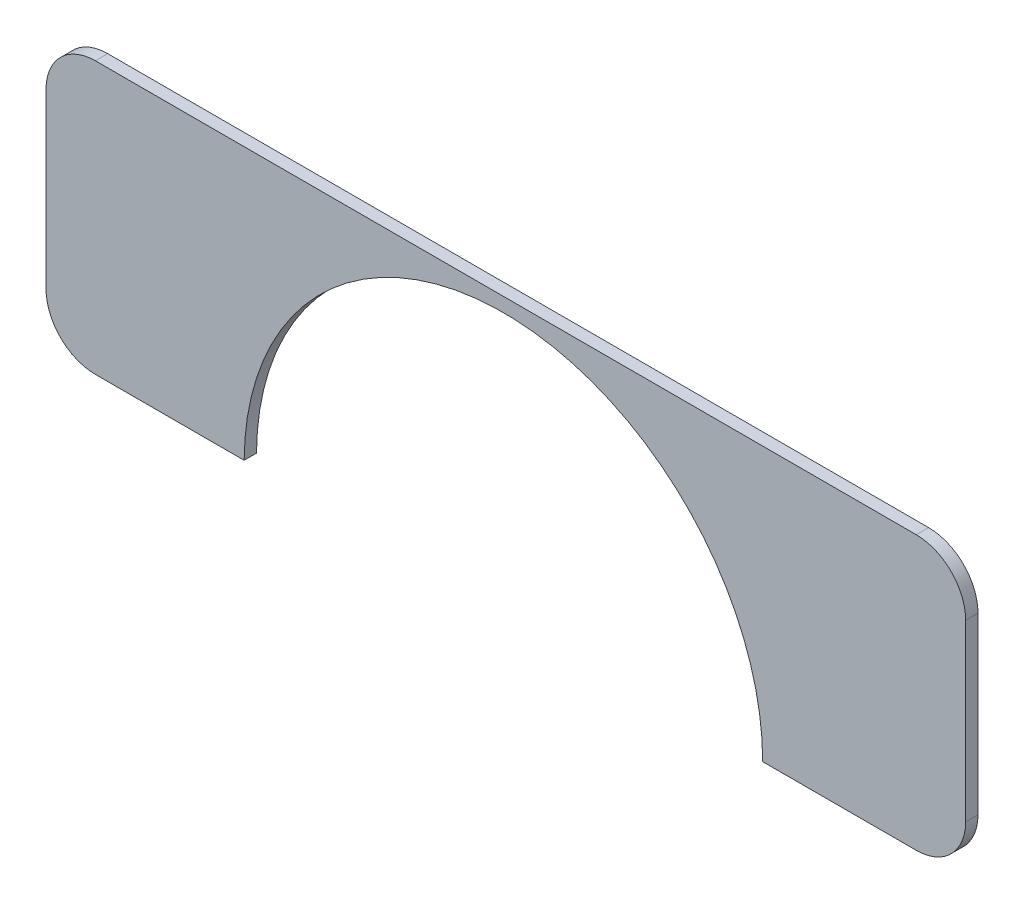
ISO-10303-21;
HEADER;
FILE_DESCRIPTION(('STEP AP214'),'2;1');
FILE_NAME('part.step','',(''),(''),'','','');
FILE_SCHEMA(('AUTOMOTIVE_DESIGN { 1 0 10303 214 1 1 1 1 }'));
ENDSEC;
DATA;
#1=APPLICATION_CONTEXT('core data for automotive mechanical design processes');
#2=APPLICATION_PROTOCOL_DEFINITION('international standard','automotive_design',2000,#1);
#3=PRODUCT_CONTEXT('',#1,'mechanical');
#4=PRODUCT('Part','Part','',(#3));
#5=PRODUCT_RELATED_PRODUCT_CATEGORY('part','',(#4));
#6=PRODUCT_DEFINITION_FORMATION('','',#4);
#7=PRODUCT_DEFINITION_CONTEXT('part definition',#1,'design');
#8=PRODUCT_DEFINITION('design','',#6,#7);
#9=PRODUCT_DEFINITION_SHAPE('','',#8);
#10=(LENGTH_UNIT() NAMED_UNIT(*) SI_UNIT(.MILLI.,.METRE.));
#11=(NAMED_UNIT(*) PLANE_ANGLE_UNIT() SI_UNIT($,.RADIAN.));
#12=(NAMED_UNIT(*) SI_UNIT($,.STERADIAN.) SOLID_ANGLE_UNIT());
#13=UNCERTAINTY_MEASURE_WITH_UNIT(LENGTH_MEASURE(1.E-05),#10,'distance_accuracy_value','');
#14=(GEOMETRIC_REPRESENTATION_CONTEXT(3) GLOBAL_UNCERTAINTY_ASSIGNED_CONTEXT((#13)) GLOBAL_UNIT_ASSIGNED_CONTEXT((#10,
#11,#12)) REPRESENTATION_CONTEXT('',''));
#15=CARTESIAN_POINT('',(0.,0.,0.));
#16=DIRECTION('',(0.,0.,1.));
#17=DIRECTION('',(1.,0.,0.));
#18=AXIS2_PLACEMENT_3D('',#15,#16,#17);
#19=CARTESIAN_POINT('',(-5.20417042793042E-12,179.513961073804,3.175));
#20=DIRECTION('',(-1.,0.,0.));
#21=DIRECTION('',(0.,0.,1.));
#22=AXIS2_PLACEMENT_3D('',#19,#20,#21);
#23=PLANE('',#22);
#24=DIRECTION('',(0.,1.,0.));
#25=VECTOR('',#24,1.);
#26=CARTESIAN_POINT('',(-5.20417042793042E-12,179.513961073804,0.));
#27=LINE('',#26,#25);
#28=CARTESIAN_POINT('',(-5.20417042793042E-12,121.92,0.));
#29=VERTEX_POINT('',#28);
#30=CARTESIAN_POINT('',(-5.20417042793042E-12,166.813961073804,0.));
#31=VERTEX_POINT('',#30);
#32=EDGE_CURVE('E137',#29,#31,#27,.T.);
#33=ORIENTED_EDGE('',*,*,#32,.T.);
#34=DIRECTION('',(0.,0.,-1.));
#35=VECTOR('',#34,1.);
#36=CARTESIAN_POINT('',(-5.20417042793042E-12,166.813961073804,3.175));
#37=LINE('',#36,#35);
#38=CARTESIAN_POINT('',(-5.20417042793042E-12,166.813961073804,3.175));
#39=VERTEX_POINT('',#38);
#40=EDGE_CURVE('E41',#31,#39,#37,.F.);
#41=ORIENTED_EDGE('',*,*,#40,.T.);
#42=DIRECTION('',(0.,1.,0.));
#43=VECTOR('',#42,1.);
#44=CARTESIAN_POINT('',(-5.20417042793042E-12,179.513961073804,3.175));
#45=LINE('',#44,#43);
#46=CARTESIAN_POINT('',(-5.20417042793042E-12,121.92,3.175));
#47=VERTEX_POINT('',#46);
#48=EDGE_CURVE('E151',#47,#39,#45,.T.);
#49=ORIENTED_EDGE('',*,*,#48,.F.);
#50=DIRECTION('',(0.,0.,-1.));
#51=VECTOR('',#50,1.);
#52=CARTESIAN_POINT('',(-5.20417042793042E-12,121.92,3.175));
#53=LINE('',#52,#51);
#54=EDGE_CURVE('E179',#47,#29,#53,.T.);
#55=ORIENTED_EDGE('',*,*,#54,.T.);
#56=EDGE_LOOP('',(#33,#41,#49,#55));
#57=FACE_BOUND('',#56,.T.);
#58=ADVANCED_FACE('F33',(#57),#23,.F.);
#59=CARTESIAN_POINT('',(-236.5,179.513961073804,3.175));
#60=DIRECTION('',(0.,-1.,0.));
#61=DIRECTION('',(0.,0.,-1.));
#62=AXIS2_PLACEMENT_3D('',#59,#60,#61);
#63=PLANE('',#62);
#64=DIRECTION('',(-1.,0.,0.));
#65=VECTOR('',#64,1.);
#66=CARTESIAN_POINT('',(-236.5,179.513961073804,0.));
#67=LINE('',#66,#65);
#68=CARTESIAN_POINT('',(-12.7000000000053,179.513961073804,0.));
#69=VERTEX_POINT('',#68);
#70=CARTESIAN_POINT('',(-223.8,179.513961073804,0.));
#71=VERTEX_POINT('',#70);
#72=EDGE_CURVE('E140',#69,#71,#67,.T.);
#73=ORIENTED_EDGE('',*,*,#72,.T.);
#74=DIRECTION('',(0.,0.,-1.));
#75=VECTOR('',#74,1.);
#76=CARTESIAN_POINT('',(-223.8,179.513961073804,3.175));
#77=LINE('',#76,#75);
#78=CARTESIAN_POINT('',(-223.8,179.513961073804,3.175));
#79=VERTEX_POINT('',#78);
#80=EDGE_CURVE('E168',#71,#79,#77,.F.);
#81=ORIENTED_EDGE('',*,*,#80,.T.);
#82=DIRECTION('',(-1.,0.,0.));
#83=VECTOR('',#82,1.);
#84=CARTESIAN_POINT('',(-236.5,179.513961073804,3.175));
#85=LINE('',#84,#83);
#86=CARTESIAN_POINT('',(-12.7000000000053,179.513961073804,3.175));
#87=VERTEX_POINT('',#86);
#88=EDGE_CURVE('E191',#87,#79,#85,.T.);
#89=ORIENTED_EDGE('',*,*,#88,.F.);
#90=DIRECTION('',(0.,0.,-1.));
#91=VECTOR('',#90,1.);
#92=CARTESIAN_POINT('',(-12.7000000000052,179.513961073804,3.175));
#93=LINE('',#92,#91);
#94=EDGE_CURVE('E165',#87,#69,#93,.T.);
#95=ORIENTED_EDGE('',*,*,#94,.T.);
#96=EDGE_LOOP('',(#73,#81,#89,#95));
#97=FACE_BOUND('',#96,.T.);
#98=ADVANCED_FACE('F197',(#97),#63,.F.);
#99=CARTESIAN_POINT('',(-236.5,109.663961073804,3.175));
#100=DIRECTION('',(1.,0.,0.));
#101=DIRECTION('',(0.,0.,-1.));
#102=AXIS2_PLACEMENT_3D('',#99,#100,#101);
#103=PLANE('',#102);
#104=DIRECTION('',(0.,-1.,0.));
#105=VECTOR('',#104,1.);
#106=CARTESIAN_POINT('',(-236.5,109.663961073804,3.175));
#107=LINE('',#106,#105);
#108=CARTESIAN_POINT('',(-236.5,166.813961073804,3.175));
#109=VERTEX_POINT('',#108);
#110=CARTESIAN_POINT('',(-236.5,122.363961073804,3.175));
#111=VERTEX_POINT('',#110);
#112=EDGE_CURVE('E118',#109,#111,#107,.T.);
#113=ORIENTED_EDGE('',*,*,#112,.F.);
#114=DIRECTION('',(0.,0.,-1.));
#115=VECTOR('',#114,1.);
#116=CARTESIAN_POINT('',(-236.5,166.813961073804,3.175));
#117=LINE('',#116,#115);
#118=CARTESIAN_POINT('',(-236.5,166.813961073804,0.));
#119=VERTEX_POINT('',#118);
#120=EDGE_CURVE('E154',#109,#119,#117,.T.);
#121=ORIENTED_EDGE('',*,*,#120,.T.);
#122=DIRECTION('',(0.,-1.,0.));
#123=VECTOR('',#122,1.);
#124=CARTESIAN_POINT('',(-236.5,109.663961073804,0.));
#125=LINE('',#124,#123);
#126=CARTESIAN_POINT('',(-236.5,122.363961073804,0.));
#127=VERTEX_POINT('',#126);
#128=EDGE_CURVE('E143',#119,#127,#125,.T.);
#129=ORIENTED_EDGE('',*,*,#128,.T.);
#130=DIRECTION('',(0.,0.,-1.));
#131=VECTOR('',#130,1.);
#132=CARTESIAN_POINT('',(-236.5,122.363961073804,3.175));
#133=LINE('',#132,#131);
#134=EDGE_CURVE('E127',#127,#111,#133,.F.);
#135=ORIENTED_EDGE('',*,*,#134,.T.);
#136=EDGE_LOOP('',(#113,#121,#129,#135));
#137=FACE_BOUND('',#136,.T.);
#138=ADVANCED_FACE('F208',(#137),#103,.F.);
#139=CARTESIAN_POINT('',(-185.545521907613,109.663961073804,3.175));
#140=DIRECTION('',(0.,1.,0.));
#141=DIRECTION('',(0.,0.,1.));
#142=AXIS2_PLACEMENT_3D('',#139,#140,#141);
#143=PLANE('',#142);
#144=DIRECTION('',(1.,0.,0.));
#145=VECTOR('',#144,1.);
#146=CARTESIAN_POINT('',(-185.545521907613,109.663961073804,3.175));
#147=LINE('',#146,#145);
#148=CARTESIAN_POINT('',(-223.8,109.663961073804,3.175));
#149=VERTEX_POINT('',#148);
#150=CARTESIAN_POINT('',(-185.545521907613,109.663961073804,3.175));
#151=VERTEX_POINT('',#150);
#152=EDGE_CURVE('E108',#149,#151,#147,.T.);
#153=ORIENTED_EDGE('',*,*,#152,.F.);
#154=DIRECTION('',(0.,0.,-1.));
#155=VECTOR('',#154,1.);
#156=CARTESIAN_POINT('',(-223.8,109.663961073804,3.175));
#157=LINE('',#156,#155);
#158=CARTESIAN_POINT('',(-223.8,109.663961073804,0.));
#159=VERTEX_POINT('',#158);
#160=EDGE_CURVE('E177',#149,#159,#157,.T.);
#161=ORIENTED_EDGE('',*,*,#160,.T.);
#162=DIRECTION('',(1.,0.,0.));
#163=VECTOR('',#162,1.);
#164=CARTESIAN_POINT('',(-185.545521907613,109.663961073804,0.));
#165=LINE('',#164,#163);
#166=CARTESIAN_POINT('',(-185.545521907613,109.663961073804,0.));
#167=VERTEX_POINT('',#166);
#168=EDGE_CURVE('E124',#159,#167,#165,.T.);
#169=ORIENTED_EDGE('',*,*,#168,.T.);
#170=DIRECTION('',(0.,0.,-1.));
#171=VECTOR('',#170,1.);
#172=CARTESIAN_POINT('',(-185.545521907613,109.663961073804,3.175));
#173=LINE('',#172,#171);
#174=EDGE_CURVE('E121',#151,#167,#173,.T.);
#175=ORIENTED_EDGE('',*,*,#174,.F.);
#176=EDGE_LOOP('',(#153,#161,#169,#175));
#177=FACE_BOUND('',#176,.T.);
#178=ADVANCED_FACE('F122',(#177),#143,.F.);
#179=CARTESIAN_POINT('',(-118.872,109.22,3.175));
#180=DIRECTION('',(0.,0.,-1.));
#181=DIRECTION('',(-1.,0.,0.));
#182=AXIS2_PLACEMENT_3D('',#179,#180,#181);
#183=CYLINDRICAL_SURFACE('',#182,66.675);
#184=CARTESIAN_POINT('',(-118.872,109.22,0.));
#185=DIRECTION('',(0.,0.,-1.));
#186=DIRECTION('',(1.,0.,0.));
#187=AXIS2_PLACEMENT_3D('',#184,#185,#186);
#188=CIRCLE('',#187,66.675);
#189=CARTESIAN_POINT('',(-52.197,109.22,0.));
#190=VERTEX_POINT('',#189);
#191=EDGE_CURVE('E147',#167,#190,#188,.T.);
#192=ORIENTED_EDGE('',*,*,#191,.T.);
#193=DIRECTION('',(0.,0.,-1.));
#194=VECTOR('',#193,1.);
#195=CARTESIAN_POINT('',(-52.197,109.22,3.175));
#196=LINE('',#195,#194);
#197=CARTESIAN_POINT('',(-52.197,109.22,3.175));
#198=VERTEX_POINT('',#197);
#199=EDGE_CURVE('E128',#198,#190,#196,.T.);
#200=ORIENTED_EDGE('',*,*,#199,.F.);
#201=CARTESIAN_POINT('',(-118.872,109.22,3.175));
#202=DIRECTION('',(0.,0.,-1.));
#203=DIRECTION('',(1.,0.,0.));
#204=AXIS2_PLACEMENT_3D('',#201,#202,#203);
#205=CIRCLE('',#204,66.675);
#206=EDGE_CURVE('E113',#151,#198,#205,.T.);
#207=ORIENTED_EDGE('',*,*,#206,.F.);
#208=ORIENTED_EDGE('',*,*,#174,.T.);
#209=EDGE_LOOP('',(#192,#200,#207,#208));
#210=FACE_BOUND('',#209,.T.);
#211=ADVANCED_FACE('F130',(#210),#183,.F.);
#212=CARTESIAN_POINT('',(-5.20417042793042E-12,109.22,3.175));
#213=DIRECTION('',(0.,1.,0.));
#214=DIRECTION('',(0.,0.,1.));
#215=AXIS2_PLACEMENT_3D('',#212,#213,#214);
#216=PLANE('',#215);
#217=DIRECTION('',(1.,0.,0.));
#218=VECTOR('',#217,1.);
#219=CARTESIAN_POINT('',(-5.20417042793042E-12,109.22,0.));
#220=LINE('',#219,#218);
#221=CARTESIAN_POINT('',(-12.7000000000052,109.22,0.));
#222=VERTEX_POINT('',#221);
#223=EDGE_CURVE('E149',#190,#222,#220,.T.);
#224=ORIENTED_EDGE('',*,*,#223,.T.);
#225=DIRECTION('',(0.,0.,-1.));
#226=VECTOR('',#225,1.);
#227=CARTESIAN_POINT('',(-12.7000000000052,109.22,3.175));
#228=LINE('',#227,#226);
#229=CARTESIAN_POINT('',(-12.7000000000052,109.22,3.175));
#230=VERTEX_POINT('',#229);
#231=EDGE_CURVE('E11',#222,#230,#228,.F.);
#232=ORIENTED_EDGE('',*,*,#231,.T.);
#233=DIRECTION('',(1.,0.,0.));
#234=VECTOR('',#233,1.);
#235=CARTESIAN_POINT('',(-5.20417042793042E-12,109.22,3.175));
#236=LINE('',#235,#234);
#237=EDGE_CURVE('E132',#198,#230,#236,.T.);
#238=ORIENTED_EDGE('',*,*,#237,.F.);
#239=ORIENTED_EDGE('',*,*,#199,.T.);
#240=EDGE_LOOP('',(#224,#232,#238,#239));
#241=FACE_BOUND('',#240,.T.);
#242=ADVANCED_FACE('F214',(#241),#216,.F.);
#243=CARTESIAN_POINT('',(-118.872,109.22,3.175));
#244=DIRECTION('',(0.,0.,1.));
#245=DIRECTION('',(1.,0.,0.));
#246=AXIS2_PLACEMENT_3D('',#243,#244,#245);
#247=PLANE('',#246);
#248=ORIENTED_EDGE('',*,*,#88,.T.);
#249=CARTESIAN_POINT('',(-223.8,166.813961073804,3.175));
#250=DIRECTION('',(0.,0.,1.));
#251=DIRECTION('',(1.,0.,0.));
#252=AXIS2_PLACEMENT_3D('',#249,#250,#251);
#253=CIRCLE('',#252,12.7);
#254=EDGE_CURVE('E175',#79,#109,#253,.T.);
#255=ORIENTED_EDGE('',*,*,#254,.T.);
#256=ORIENTED_EDGE('',*,*,#112,.T.);
#257=CARTESIAN_POINT('',(-223.8,122.363961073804,3.175));
#258=DIRECTION('',(0.,0.,1.));
#259=DIRECTION('',(1.,0.,0.));
#260=AXIS2_PLACEMENT_3D('',#257,#258,#259);
#261=CIRCLE('',#260,12.7);
#262=EDGE_CURVE('E54',#111,#149,#261,.T.);
#263=ORIENTED_EDGE('',*,*,#262,.T.);
#264=ORIENTED_EDGE('',*,*,#152,.T.);
#265=ORIENTED_EDGE('',*,*,#206,.T.);
#266=ORIENTED_EDGE('',*,*,#237,.T.);
#267=CARTESIAN_POINT('',(-12.7000000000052,121.92,3.175));
#268=DIRECTION('',(0.,0.,1.));
#269=DIRECTION('',(1.,0.,0.));
#270=AXIS2_PLACEMENT_3D('',#267,#268,#269);
#271=CIRCLE('',#270,12.7);
#272=EDGE_CURVE('E170',#230,#47,#271,.T.);
#273=ORIENTED_EDGE('',*,*,#272,.T.);
#274=ORIENTED_EDGE('',*,*,#48,.T.);
#275=CARTESIAN_POINT('',(-12.7000000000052,166.813961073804,3.175));
#276=DIRECTION('',(0.,0.,1.));
#277=DIRECTION('',(1.,0.,0.));
#278=AXIS2_PLACEMENT_3D('',#275,#276,#277);
#279=CIRCLE('',#278,12.7);
#280=EDGE_CURVE('E172',#39,#87,#279,.T.);
#281=ORIENTED_EDGE('',*,*,#280,.T.);
#282=EDGE_LOOP('',(#248,#255,#256,#263,#264,#265,#266,#273,#274,#281));
#283=FACE_BOUND('',#282,.T.);
#284=ADVANCED_FACE('F111',(#283),#247,.T.);
#285=CARTESIAN_POINT('',(-118.872,109.22,0.));
#286=DIRECTION('',(0.,0.,1.));
#287=DIRECTION('',(1.,0.,0.));
#288=AXIS2_PLACEMENT_3D('',#285,#286,#287);
#289=PLANE('',#288);
#290=ORIENTED_EDGE('',*,*,#128,.F.);
#291=CARTESIAN_POINT('',(-223.8,166.813961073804,0.));
#292=DIRECTION('',(0.,0.,1.));
#293=DIRECTION('',(1.,0.,0.));
#294=AXIS2_PLACEMENT_3D('',#291,#292,#293);
#295=CIRCLE('',#294,12.7);
#296=EDGE_CURVE('E163',#119,#71,#295,.F.);
#297=ORIENTED_EDGE('',*,*,#296,.T.);
#298=ORIENTED_EDGE('',*,*,#72,.F.);
#299=CARTESIAN_POINT('',(-12.7000000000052,166.813961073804,0.));
#300=DIRECTION('',(0.,0.,1.));
#301=DIRECTION('',(1.,0.,0.));
#302=AXIS2_PLACEMENT_3D('',#299,#300,#301);
#303=CIRCLE('',#302,12.7);
#304=EDGE_CURVE('E159',#69,#31,#303,.F.);
#305=ORIENTED_EDGE('',*,*,#304,.T.);
#306=ORIENTED_EDGE('',*,*,#32,.F.);
#307=CARTESIAN_POINT('',(-12.7000000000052,121.92,0.));
#308=DIRECTION('',(0.,0.,1.));
#309=DIRECTION('',(1.,0.,0.));
#310=AXIS2_PLACEMENT_3D('',#307,#308,#309);
#311=CIRCLE('',#310,12.7);
#312=EDGE_CURVE('E157',#29,#222,#311,.F.);
#313=ORIENTED_EDGE('',*,*,#312,.T.);
#314=ORIENTED_EDGE('',*,*,#223,.F.);
#315=ORIENTED_EDGE('',*,*,#191,.F.);
#316=ORIENTED_EDGE('',*,*,#168,.F.);
#317=CARTESIAN_POINT('',(-223.8,122.363961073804,0.));
#318=DIRECTION('',(0.,0.,1.));
#319=DIRECTION('',(1.,0.,0.));
#320=AXIS2_PLACEMENT_3D('',#317,#318,#319);
#321=CIRCLE('',#320,12.7);
#322=EDGE_CURVE('E161',#159,#127,#321,.F.);
#323=ORIENTED_EDGE('',*,*,#322,.T.);
#324=EDGE_LOOP('',(#290,#297,#298,#305,#306,#313,#314,#315,#316,#323));
#325=FACE_BOUND('',#324,.T.);
#326=ADVANCED_FACE('F201',(#325),#289,.F.);
#327=CARTESIAN_POINT('',(-223.8,166.813961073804,3.175));
#328=DIRECTION('',(0.,0.,-1.));
#329=DIRECTION('',(-1.,0.,0.));
#330=AXIS2_PLACEMENT_3D('',#327,#328,#329);
#331=CYLINDRICAL_SURFACE('',#330,12.7);
#332=ORIENTED_EDGE('',*,*,#254,.F.);
#333=ORIENTED_EDGE('',*,*,#80,.F.);
#334=ORIENTED_EDGE('',*,*,#296,.F.);
#335=ORIENTED_EDGE('',*,*,#120,.F.);
#336=EDGE_LOOP('',(#332,#333,#334,#335));
#337=FACE_BOUND('',#336,.T.);
#338=ADVANCED_FACE('F205',(#337),#331,.T.);
#339=CARTESIAN_POINT('',(-223.8,122.363961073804,3.175));
#340=DIRECTION('',(0.,0.,-1.));
#341=DIRECTION('',(-1.,0.,0.));
#342=AXIS2_PLACEMENT_3D('',#339,#340,#341);
#343=CYLINDRICAL_SURFACE('',#342,12.7);
#344=ORIENTED_EDGE('',*,*,#262,.F.);
#345=ORIENTED_EDGE('',*,*,#134,.F.);
#346=ORIENTED_EDGE('',*,*,#322,.F.);
#347=ORIENTED_EDGE('',*,*,#160,.F.);
#348=EDGE_LOOP('',(#344,#345,#346,#347));
#349=FACE_BOUND('',#348,.T.);
#350=ADVANCED_FACE('F212',(#349),#343,.T.);
#351=CARTESIAN_POINT('',(-12.7000000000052,166.813961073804,3.175));
#352=DIRECTION('',(0.,0.,-1.));
#353=DIRECTION('',(-1.,0.,0.));
#354=AXIS2_PLACEMENT_3D('',#351,#352,#353);
#355=CYLINDRICAL_SURFACE('',#354,12.7);
#356=ORIENTED_EDGE('',*,*,#280,.F.);
#357=ORIENTED_EDGE('',*,*,#40,.F.);
#358=ORIENTED_EDGE('',*,*,#304,.F.);
#359=ORIENTED_EDGE('',*,*,#94,.F.);
#360=EDGE_LOOP('',(#356,#357,#358,#359));
#361=FACE_BOUND('',#360,.T.);
#362=ADVANCED_FACE('F194',(#361),#355,.T.);
#363=CARTESIAN_POINT('',(-12.7000000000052,121.92,3.175));
#364=DIRECTION('',(0.,0.,-1.));
#365=DIRECTION('',(-1.,0.,0.));
#366=AXIS2_PLACEMENT_3D('',#363,#364,#365);
#367=CYLINDRICAL_SURFACE('',#366,12.7);
#368=ORIENTED_EDGE('',*,*,#272,.F.);
#369=ORIENTED_EDGE('',*,*,#231,.F.);
#370=ORIENTED_EDGE('',*,*,#312,.F.);
#371=ORIENTED_EDGE('',*,*,#54,.F.);
#372=EDGE_LOOP('',(#368,#369,#370,#371));
#373=FACE_BOUND('',#372,.T.);
#374=ADVANCED_FACE('F35',(#373),#367,.T.);
#375=CLOSED_SHELL('',(#58,#98,#138,#178,#211,#242,#284,#326,#338,#350,#362,#374));
#376=MANIFOLD_SOLID_BREP('B2',#375);
#377=ADVANCED_BREP_SHAPE_REPRESENTATION('',(#18,#376),#14);
#378=SHAPE_DEFINITION_REPRESENTATION(#9,#377);
ENDSEC;
END-ISO-10303-21;
